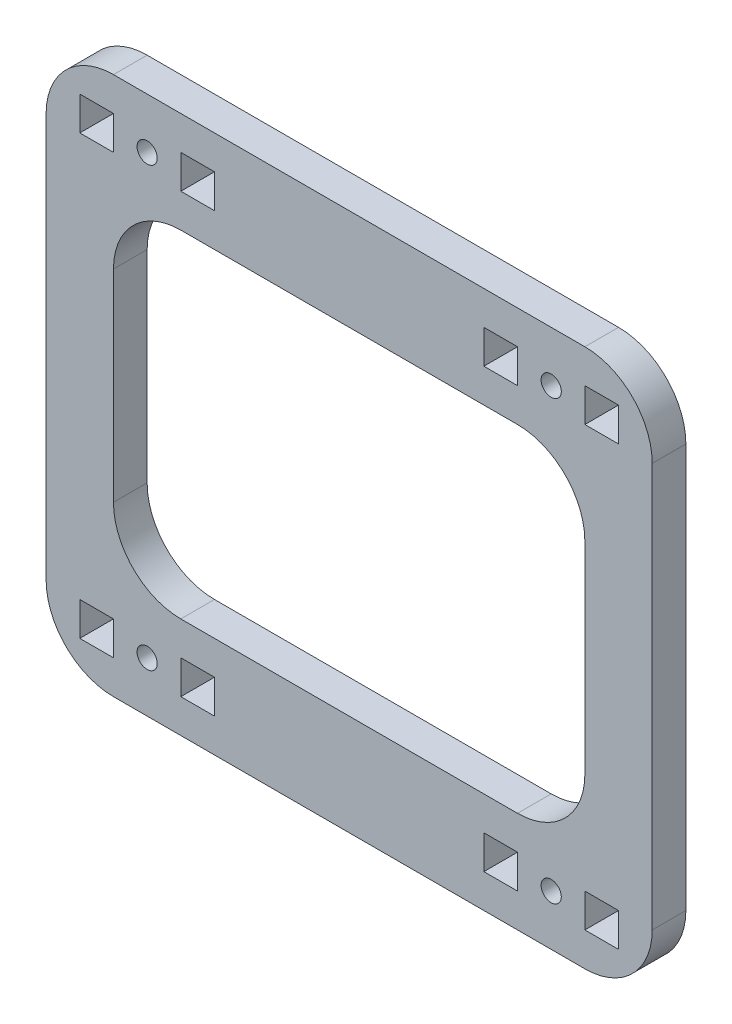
from build123d import *

# Parameters (mm, degrees)
ESQUISSE1_W        = 90
ESQUISSE1_H        = 80
ESQUISSE1_R        = 1.5
ESQUISSE1_W_2      = 70
ESQUISSE1_H_2      = 50
ESQUISSE1_W_3      = 5
ESQUISSE1_H_3      = 5
BOSS_EXTRU_1_DEPTH = 5
CONG_1_R           = 10


with BuildPart() as part:
    # Esquisse1 → Boss.-Extru.1 (new body)
    with BuildSketch(Plane.XY):
        with Locations((45, 40)):
            Rectangle(ESQUISSE1_W, ESQUISSE1_H)
        with Locations((15, 72.5)):
            Circle(ESQUISSE1_R, mode=Mode.SUBTRACT)
        with Locations(Location((15, 7.5, 0), (0, 0, 90))):
            Circle(ESQUISSE1_R, mode=Mode.SUBTRACT)
        with Locations(Location((75, 72.5, 0), (0, 0, 180))):
            Circle(ESQUISSE1_R, mode=Mode.SUBTRACT)
        with Locations((75, 7.5)):
            Circle(ESQUISSE1_R, mode=Mode.SUBTRACT)
        with Locations((45, 40)):
            Rectangle(ESQUISSE1_W_2, ESQUISSE1_H_2, mode=Mode.SUBTRACT)
        with Locations((7.5, 72.5)):
            Rectangle(ESQUISSE1_W_3, ESQUISSE1_H_3, mode=Mode.SUBTRACT)
        with Locations((22.5, 72.5)):
            Rectangle(ESQUISSE1_W_3, ESQUISSE1_H_3, mode=Mode.SUBTRACT)
        with Locations((7.5, 7.5)):
            Rectangle(ESQUISSE1_W_3, ESQUISSE1_H_3, mode=Mode.SUBTRACT)
        with Locations((22.5, 7.5)):
            Rectangle(ESQUISSE1_W_3, ESQUISSE1_H_3, mode=Mode.SUBTRACT)
        with Locations((82.5, 72.5)):
            Rectangle(ESQUISSE1_W_3, ESQUISSE1_H_3, mode=Mode.SUBTRACT)
        with Locations((67.5, 72.5)):
            Rectangle(ESQUISSE1_W_3, ESQUISSE1_H_3, mode=Mode.SUBTRACT)
        with Locations((82.5, 7.5)):
            Rectangle(ESQUISSE1_W_3, ESQUISSE1_H_3, mode=Mode.SUBTRACT)
        with Locations((67.5, 7.5)):
            Rectangle(ESQUISSE1_W_3, ESQUISSE1_H_3, mode=Mode.SUBTRACT)
    extrude(amount=BOSS_EXTRU_1_DEPTH)

    # Cong_1
    cong_1_edges = [part.edges().sort_by_distance(p)[0] for p in [
        (10, 65, 2.5),
        (10, 15, 2.5),
        (80, 15, 2.5),
        (80, 65, 2.5),
        (0, 0, 2.5),
        (0, 80, 2.5),
        (90, 80, 2.5),
        (90, 0, 2.5),
    ]]
    fillet(cong_1_edges, radius=CONG_1_R)


solid = part.part
